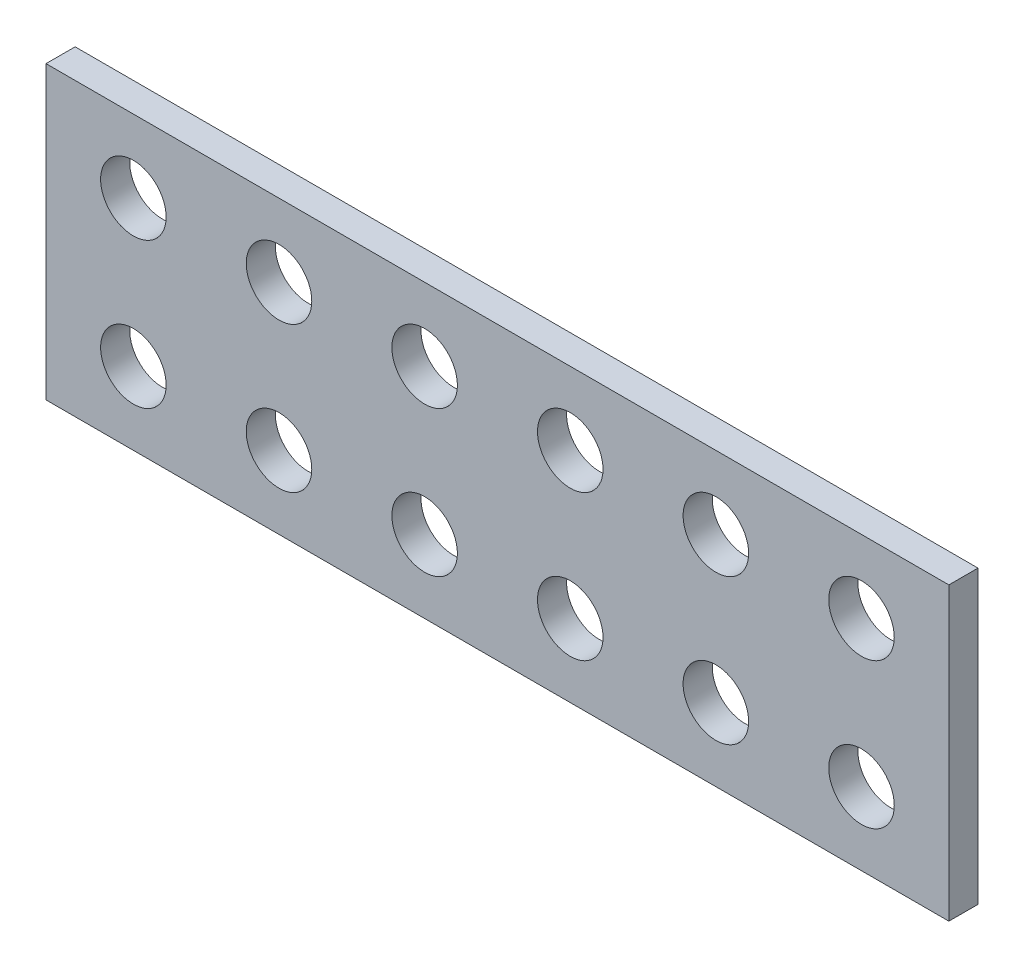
ISO-10303-21;
HEADER;
FILE_DESCRIPTION(('STEP AP214'),'2;1');
FILE_NAME('part.step','',(''),(''),'','','');
FILE_SCHEMA(('AUTOMOTIVE_DESIGN { 1 0 10303 214 1 1 1 1 }'));
ENDSEC;
DATA;
#1=APPLICATION_CONTEXT('core data for automotive mechanical design processes');
#2=APPLICATION_PROTOCOL_DEFINITION('international standard','automotive_design',2000,#1);
#3=PRODUCT_CONTEXT('',#1,'mechanical');
#4=PRODUCT('Part','Part','',(#3));
#5=PRODUCT_RELATED_PRODUCT_CATEGORY('part','',(#4));
#6=PRODUCT_DEFINITION_FORMATION('','',#4);
#7=PRODUCT_DEFINITION_CONTEXT('part definition',#1,'design');
#8=PRODUCT_DEFINITION('design','',#6,#7);
#9=PRODUCT_DEFINITION_SHAPE('','',#8);
#10=(LENGTH_UNIT() NAMED_UNIT(*) SI_UNIT(.MILLI.,.METRE.));
#11=(NAMED_UNIT(*) PLANE_ANGLE_UNIT() SI_UNIT($,.RADIAN.));
#12=(NAMED_UNIT(*) SI_UNIT($,.STERADIAN.) SOLID_ANGLE_UNIT());
#13=UNCERTAINTY_MEASURE_WITH_UNIT(LENGTH_MEASURE(1.E-05),#10,'distance_accuracy_value','');
#14=(GEOMETRIC_REPRESENTATION_CONTEXT(3) GLOBAL_UNCERTAINTY_ASSIGNED_CONTEXT((#13)) GLOBAL_UNIT_ASSIGNED_CONTEXT((#10,
#11,#12)) REPRESENTATION_CONTEXT('',''));
#15=CARTESIAN_POINT('',(0.,0.,0.));
#16=DIRECTION('',(0.,0.,1.));
#17=DIRECTION('',(1.,0.,0.));
#18=AXIS2_PLACEMENT_3D('',#15,#16,#17);
#19=CARTESIAN_POINT('',(0.,0.,4.));
#20=DIRECTION('',(0.,0.,-1.));
#21=DIRECTION('',(-1.,0.,0.));
#22=AXIS2_PLACEMENT_3D('',#19,#20,#21);
#23=PLANE('',#22);
#24=CARTESIAN_POINT('',(20.0000000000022,40.,4.));
#25=DIRECTION('',(0.,0.,1.));
#26=DIRECTION('',(1.,0.,0.));
#27=AXIS2_PLACEMENT_3D('',#24,#25,#26);
#28=CIRCLE('',#27,4.5);
#29=CARTESIAN_POINT('',(24.5000000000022,40.,4.));
#30=VERTEX_POINT('',#29);
#31=EDGE_CURVE('E40',#30,#30,#28,.T.);
#32=ORIENTED_EDGE('',*,*,#31,.F.);
#33=EDGE_LOOP('',(#32));
#34=FACE_BOUND('',#33,.T.);
#35=CARTESIAN_POINT('',(40.0000000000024,20.,4.));
#36=DIRECTION('',(0.,0.,1.));
#37=DIRECTION('',(1.,0.,0.));
#38=AXIS2_PLACEMENT_3D('',#35,#36,#37);
#39=CIRCLE('',#38,4.50000000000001);
#40=CARTESIAN_POINT('',(44.5000000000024,20.,4.));
#41=VERTEX_POINT('',#40);
#42=EDGE_CURVE('E162',#41,#41,#39,.T.);
#43=ORIENTED_EDGE('',*,*,#42,.F.);
#44=EDGE_LOOP('',(#43));
#45=FACE_BOUND('',#44,.T.);
#46=CARTESIAN_POINT('',(60.0000000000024,20.,4.));
#47=DIRECTION('',(0.,0.,1.));
#48=DIRECTION('',(1.,0.,0.));
#49=AXIS2_PLACEMENT_3D('',#46,#47,#48);
#50=CIRCLE('',#49,4.49999999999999);
#51=CARTESIAN_POINT('',(64.5000000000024,20.,4.));
#52=VERTEX_POINT('',#51);
#53=EDGE_CURVE('E168',#52,#52,#50,.T.);
#54=ORIENTED_EDGE('',*,*,#53,.F.);
#55=EDGE_LOOP('',(#54));
#56=FACE_BOUND('',#55,.T.);
#57=CARTESIAN_POINT('',(80.0000000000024,20.,4.));
#58=DIRECTION('',(0.,0.,1.));
#59=DIRECTION('',(1.,0.,0.));
#60=AXIS2_PLACEMENT_3D('',#57,#58,#59);
#61=CIRCLE('',#60,4.50000000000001);
#62=CARTESIAN_POINT('',(84.5000000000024,20.,4.));
#63=VERTEX_POINT('',#62);
#64=EDGE_CURVE('E157',#63,#63,#61,.T.);
#65=ORIENTED_EDGE('',*,*,#64,.F.);
#66=EDGE_LOOP('',(#65));
#67=FACE_BOUND('',#66,.T.);
#68=CARTESIAN_POINT('',(20.0000000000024,20.,4.));
#69=DIRECTION('',(0.,0.,1.));
#70=DIRECTION('',(1.,0.,0.));
#71=AXIS2_PLACEMENT_3D('',#68,#69,#70);
#72=CIRCLE('',#71,4.5);
#73=CARTESIAN_POINT('',(24.5000000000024,20.,4.));
#74=VERTEX_POINT('',#73);
#75=EDGE_CURVE('E108',#74,#74,#72,.T.);
#76=ORIENTED_EDGE('',*,*,#75,.F.);
#77=EDGE_LOOP('',(#76));
#78=FACE_BOUND('',#77,.T.);
#79=CARTESIAN_POINT('',(120.000000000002,20.,4.));
#80=DIRECTION('',(0.,0.,1.));
#81=DIRECTION('',(1.,0.,0.));
#82=AXIS2_PLACEMENT_3D('',#79,#80,#81);
#83=CIRCLE('',#82,4.50000000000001);
#84=CARTESIAN_POINT('',(124.500000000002,20.,4.));
#85=VERTEX_POINT('',#84);
#86=EDGE_CURVE('E146',#85,#85,#83,.T.);
#87=ORIENTED_EDGE('',*,*,#86,.F.);
#88=EDGE_LOOP('',(#87));
#89=FACE_BOUND('',#88,.T.);
#90=CARTESIAN_POINT('',(100.000000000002,20.,4.));
#91=DIRECTION('',(0.,0.,1.));
#92=DIRECTION('',(1.,0.,0.));
#93=AXIS2_PLACEMENT_3D('',#90,#91,#92);
#94=CIRCLE('',#93,4.50000000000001);
#95=CARTESIAN_POINT('',(104.500000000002,20.,4.));
#96=VERTEX_POINT('',#95);
#97=EDGE_CURVE('E145',#96,#96,#94,.T.);
#98=ORIENTED_EDGE('',*,*,#97,.F.);
#99=EDGE_LOOP('',(#98));
#100=FACE_BOUND('',#99,.T.);
#101=CARTESIAN_POINT('',(120.000000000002,40.,4.));
#102=DIRECTION('',(0.,0.,1.));
#103=DIRECTION('',(1.,0.,0.));
#104=AXIS2_PLACEMENT_3D('',#101,#102,#103);
#105=CIRCLE('',#104,4.50000000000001);
#106=CARTESIAN_POINT('',(124.500000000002,40.,4.));
#107=VERTEX_POINT('',#106);
#108=EDGE_CURVE('E138',#107,#107,#105,.T.);
#109=ORIENTED_EDGE('',*,*,#108,.F.);
#110=EDGE_LOOP('',(#109));
#111=FACE_BOUND('',#110,.T.);
#112=CARTESIAN_POINT('',(100.000000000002,40.,4.));
#113=DIRECTION('',(0.,0.,1.));
#114=DIRECTION('',(1.,0.,0.));
#115=AXIS2_PLACEMENT_3D('',#112,#113,#114);
#116=CIRCLE('',#115,4.50000000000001);
#117=CARTESIAN_POINT('',(104.500000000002,40.,4.));
#118=VERTEX_POINT('',#117);
#119=EDGE_CURVE('E132',#118,#118,#116,.T.);
#120=ORIENTED_EDGE('',*,*,#119,.F.);
#121=EDGE_LOOP('',(#120));
#122=FACE_BOUND('',#121,.T.);
#123=CARTESIAN_POINT('',(80.0000000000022,40.,4.));
#124=DIRECTION('',(0.,0.,1.));
#125=DIRECTION('',(1.,0.,0.));
#126=AXIS2_PLACEMENT_3D('',#123,#124,#125);
#127=CIRCLE('',#126,4.50000000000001);
#128=CARTESIAN_POINT('',(84.5000000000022,40.,4.));
#129=VERTEX_POINT('',#128);
#130=EDGE_CURVE('E126',#129,#129,#127,.T.);
#131=ORIENTED_EDGE('',*,*,#130,.F.);
#132=EDGE_LOOP('',(#131));
#133=FACE_BOUND('',#132,.T.);
#134=CARTESIAN_POINT('',(60.0000000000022,40.,4.));
#135=DIRECTION('',(0.,0.,1.));
#136=DIRECTION('',(1.,0.,0.));
#137=AXIS2_PLACEMENT_3D('',#134,#135,#136);
#138=CIRCLE('',#137,4.50000000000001);
#139=CARTESIAN_POINT('',(64.5000000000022,40.,4.));
#140=VERTEX_POINT('',#139);
#141=EDGE_CURVE('E120',#140,#140,#138,.T.);
#142=ORIENTED_EDGE('',*,*,#141,.F.);
#143=EDGE_LOOP('',(#142));
#144=FACE_BOUND('',#143,.T.);
#145=CARTESIAN_POINT('',(40.0000000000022,40.,4.));
#146=DIRECTION('',(0.,0.,1.));
#147=DIRECTION('',(1.,0.,0.));
#148=AXIS2_PLACEMENT_3D('',#145,#146,#147);
#149=CIRCLE('',#148,4.50000000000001);
#150=CARTESIAN_POINT('',(44.5000000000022,40.,4.));
#151=VERTEX_POINT('',#150);
#152=EDGE_CURVE('E114',#151,#151,#149,.T.);
#153=ORIENTED_EDGE('',*,*,#152,.F.);
#154=EDGE_LOOP('',(#153));
#155=FACE_BOUND('',#154,.T.);
#156=DIRECTION('',(0.,-1.,0.));
#157=VECTOR('',#156,1.);
#158=CARTESIAN_POINT('',(8.,10.,4.));
#159=LINE('',#158,#157);
#160=CARTESIAN_POINT('',(8.,50.,4.));
#161=VERTEX_POINT('',#160);
#162=CARTESIAN_POINT('',(8.00000000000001,10.,4.));
#163=VERTEX_POINT('',#162);
#164=EDGE_CURVE('E100',#161,#163,#159,.T.);
#165=ORIENTED_EDGE('',*,*,#164,.T.);
#166=DIRECTION('',(1.,0.,0.));
#167=VECTOR('',#166,1.);
#168=CARTESIAN_POINT('',(8.,10.,4.));
#169=LINE('',#168,#167);
#170=CARTESIAN_POINT('',(132.,10.,4.));
#171=VERTEX_POINT('',#170);
#172=EDGE_CURVE('E103',#163,#171,#169,.T.);
#173=ORIENTED_EDGE('',*,*,#172,.T.);
#174=DIRECTION('',(0.,1.,0.));
#175=VECTOR('',#174,1.);
#176=CARTESIAN_POINT('',(132.,10.,4.));
#177=LINE('',#176,#175);
#178=CARTESIAN_POINT('',(132.,50.,4.));
#179=VERTEX_POINT('',#178);
#180=EDGE_CURVE('E51',#171,#179,#177,.T.);
#181=ORIENTED_EDGE('',*,*,#180,.T.);
#182=DIRECTION('',(-1.,0.,0.));
#183=VECTOR('',#182,1.);
#184=CARTESIAN_POINT('',(8.,50.,4.));
#185=LINE('',#184,#183);
#186=EDGE_CURVE('E83',#179,#161,#185,.T.);
#187=ORIENTED_EDGE('',*,*,#186,.T.);
#188=EDGE_LOOP('',(#165,#173,#181,#187));
#189=FACE_BOUND('',#188,.T.);
#190=ADVANCED_FACE('F36',(#34,#45,#56,#67,#78,#89,#100,#111,#122,#133,#144,#155,#189),#23,.F.);
#191=CARTESIAN_POINT('',(0.,0.,0.));
#192=DIRECTION('',(0.,0.,-1.));
#193=DIRECTION('',(-1.,0.,0.));
#194=AXIS2_PLACEMENT_3D('',#191,#192,#193);
#195=PLANE('',#194);
#196=CARTESIAN_POINT('',(20.0000000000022,40.,0.));
#197=DIRECTION('',(0.,0.,1.));
#198=DIRECTION('',(1.,0.,0.));
#199=AXIS2_PLACEMENT_3D('',#196,#197,#198);
#200=CIRCLE('',#199,4.5);
#201=CARTESIAN_POINT('',(24.5000000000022,40.,0.));
#202=VERTEX_POINT('',#201);
#203=EDGE_CURVE('E12',#202,#202,#200,.T.);
#204=ORIENTED_EDGE('',*,*,#203,.T.);
#205=EDGE_LOOP('',(#204));
#206=FACE_BOUND('',#205,.T.);
#207=CARTESIAN_POINT('',(40.0000000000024,20.,0.));
#208=DIRECTION('',(0.,0.,1.));
#209=DIRECTION('',(1.,0.,0.));
#210=AXIS2_PLACEMENT_3D('',#207,#208,#209);
#211=CIRCLE('',#210,4.50000000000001);
#212=CARTESIAN_POINT('',(44.5000000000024,20.,0.));
#213=VERTEX_POINT('',#212);
#214=EDGE_CURVE('E141',#213,#213,#211,.T.);
#215=ORIENTED_EDGE('',*,*,#214,.T.);
#216=EDGE_LOOP('',(#215));
#217=FACE_BOUND('',#216,.T.);
#218=CARTESIAN_POINT('',(60.0000000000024,20.,0.));
#219=DIRECTION('',(0.,0.,1.));
#220=DIRECTION('',(1.,0.,0.));
#221=AXIS2_PLACEMENT_3D('',#218,#219,#220);
#222=CIRCLE('',#221,4.49999999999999);
#223=CARTESIAN_POINT('',(64.5000000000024,20.,0.));
#224=VERTEX_POINT('',#223);
#225=EDGE_CURVE('E165',#224,#224,#222,.T.);
#226=ORIENTED_EDGE('',*,*,#225,.T.);
#227=EDGE_LOOP('',(#226));
#228=FACE_BOUND('',#227,.T.);
#229=CARTESIAN_POINT('',(80.0000000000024,20.,0.));
#230=DIRECTION('',(0.,0.,1.));
#231=DIRECTION('',(1.,0.,0.));
#232=AXIS2_PLACEMENT_3D('',#229,#230,#231);
#233=CIRCLE('',#232,4.50000000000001);
#234=CARTESIAN_POINT('',(84.5000000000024,20.,0.));
#235=VERTEX_POINT('',#234);
#236=EDGE_CURVE('E171',#235,#235,#233,.T.);
#237=ORIENTED_EDGE('',*,*,#236,.T.);
#238=EDGE_LOOP('',(#237));
#239=FACE_BOUND('',#238,.T.);
#240=CARTESIAN_POINT('',(20.0000000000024,20.,0.));
#241=DIRECTION('',(0.,0.,1.));
#242=DIRECTION('',(1.,0.,0.));
#243=AXIS2_PLACEMENT_3D('',#240,#241,#242);
#244=CIRCLE('',#243,4.5);
#245=CARTESIAN_POINT('',(24.5000000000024,20.,0.));
#246=VERTEX_POINT('',#245);
#247=EDGE_CURVE('E149',#246,#246,#244,.T.);
#248=ORIENTED_EDGE('',*,*,#247,.T.);
#249=EDGE_LOOP('',(#248));
#250=FACE_BOUND('',#249,.T.);
#251=CARTESIAN_POINT('',(120.000000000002,20.,0.));
#252=DIRECTION('',(0.,0.,1.));
#253=DIRECTION('',(1.,0.,0.));
#254=AXIS2_PLACEMENT_3D('',#251,#252,#253);
#255=CIRCLE('',#254,4.50000000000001);
#256=CARTESIAN_POINT('',(124.500000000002,20.,0.));
#257=VERTEX_POINT('',#256);
#258=EDGE_CURVE('E142',#257,#257,#255,.T.);
#259=ORIENTED_EDGE('',*,*,#258,.T.);
#260=EDGE_LOOP('',(#259));
#261=FACE_BOUND('',#260,.T.);
#262=CARTESIAN_POINT('',(100.000000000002,20.,0.));
#263=DIRECTION('',(0.,0.,1.));
#264=DIRECTION('',(1.,0.,0.));
#265=AXIS2_PLACEMENT_3D('',#262,#263,#264);
#266=CIRCLE('',#265,4.50000000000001);
#267=CARTESIAN_POINT('',(104.500000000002,20.,0.));
#268=VERTEX_POINT('',#267);
#269=EDGE_CURVE('E154',#268,#268,#266,.T.);
#270=ORIENTED_EDGE('',*,*,#269,.T.);
#271=EDGE_LOOP('',(#270));
#272=FACE_BOUND('',#271,.T.);
#273=CARTESIAN_POINT('',(120.000000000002,40.,0.));
#274=DIRECTION('',(0.,0.,1.));
#275=DIRECTION('',(1.,0.,0.));
#276=AXIS2_PLACEMENT_3D('',#273,#274,#275);
#277=CIRCLE('',#276,4.50000000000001);
#278=CARTESIAN_POINT('',(124.500000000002,40.,0.));
#279=VERTEX_POINT('',#278);
#280=EDGE_CURVE('E135',#279,#279,#277,.T.);
#281=ORIENTED_EDGE('',*,*,#280,.T.);
#282=EDGE_LOOP('',(#281));
#283=FACE_BOUND('',#282,.T.);
#284=CARTESIAN_POINT('',(100.000000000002,40.,0.));
#285=DIRECTION('',(0.,0.,1.));
#286=DIRECTION('',(1.,0.,0.));
#287=AXIS2_PLACEMENT_3D('',#284,#285,#286);
#288=CIRCLE('',#287,4.50000000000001);
#289=CARTESIAN_POINT('',(104.500000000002,40.,0.));
#290=VERTEX_POINT('',#289);
#291=EDGE_CURVE('E129',#290,#290,#288,.T.);
#292=ORIENTED_EDGE('',*,*,#291,.T.);
#293=EDGE_LOOP('',(#292));
#294=FACE_BOUND('',#293,.T.);
#295=CARTESIAN_POINT('',(80.0000000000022,40.,0.));
#296=DIRECTION('',(0.,0.,1.));
#297=DIRECTION('',(1.,0.,0.));
#298=AXIS2_PLACEMENT_3D('',#295,#296,#297);
#299=CIRCLE('',#298,4.50000000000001);
#300=CARTESIAN_POINT('',(84.5000000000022,40.,0.));
#301=VERTEX_POINT('',#300);
#302=EDGE_CURVE('E123',#301,#301,#299,.T.);
#303=ORIENTED_EDGE('',*,*,#302,.T.);
#304=EDGE_LOOP('',(#303));
#305=FACE_BOUND('',#304,.T.);
#306=CARTESIAN_POINT('',(60.0000000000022,40.,0.));
#307=DIRECTION('',(0.,0.,1.));
#308=DIRECTION('',(1.,0.,0.));
#309=AXIS2_PLACEMENT_3D('',#306,#307,#308);
#310=CIRCLE('',#309,4.50000000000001);
#311=CARTESIAN_POINT('',(64.5000000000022,40.,0.));
#312=VERTEX_POINT('',#311);
#313=EDGE_CURVE('E117',#312,#312,#310,.T.);
#314=ORIENTED_EDGE('',*,*,#313,.T.);
#315=EDGE_LOOP('',(#314));
#316=FACE_BOUND('',#315,.T.);
#317=CARTESIAN_POINT('',(40.0000000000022,40.,0.));
#318=DIRECTION('',(0.,0.,1.));
#319=DIRECTION('',(1.,0.,0.));
#320=AXIS2_PLACEMENT_3D('',#317,#318,#319);
#321=CIRCLE('',#320,4.50000000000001);
#322=CARTESIAN_POINT('',(44.5000000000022,40.,0.));
#323=VERTEX_POINT('',#322);
#324=EDGE_CURVE('E111',#323,#323,#321,.T.);
#325=ORIENTED_EDGE('',*,*,#324,.T.);
#326=EDGE_LOOP('',(#325));
#327=FACE_BOUND('',#326,.T.);
#328=DIRECTION('',(1.,0.,0.));
#329=VECTOR('',#328,1.);
#330=CARTESIAN_POINT('',(8.,10.,0.));
#331=LINE('',#330,#329);
#332=CARTESIAN_POINT('',(8.,10.,0.));
#333=VERTEX_POINT('',#332);
#334=CARTESIAN_POINT('',(132.,10.,0.));
#335=VERTEX_POINT('',#334);
#336=EDGE_CURVE('E93',#333,#335,#331,.T.);
#337=ORIENTED_EDGE('',*,*,#336,.F.);
#338=DIRECTION('',(0.,-1.,0.));
#339=VECTOR('',#338,1.);
#340=CARTESIAN_POINT('',(8.,10.,0.));
#341=LINE('',#340,#339);
#342=CARTESIAN_POINT('',(8.,50.,0.));
#343=VERTEX_POINT('',#342);
#344=EDGE_CURVE('E59',#343,#333,#341,.T.);
#345=ORIENTED_EDGE('',*,*,#344,.F.);
#346=DIRECTION('',(-1.,0.,0.));
#347=VECTOR('',#346,1.);
#348=CARTESIAN_POINT('',(8.,50.,0.));
#349=LINE('',#348,#347);
#350=CARTESIAN_POINT('',(132.,50.,0.));
#351=VERTEX_POINT('',#350);
#352=EDGE_CURVE('E81',#351,#343,#349,.T.);
#353=ORIENTED_EDGE('',*,*,#352,.F.);
#354=DIRECTION('',(0.,1.,0.));
#355=VECTOR('',#354,1.);
#356=CARTESIAN_POINT('',(132.,10.,0.));
#357=LINE('',#356,#355);
#358=EDGE_CURVE('E88',#335,#351,#357,.T.);
#359=ORIENTED_EDGE('',*,*,#358,.F.);
#360=EDGE_LOOP('',(#337,#345,#353,#359));
#361=FACE_BOUND('',#360,.T.);
#362=ADVANCED_FACE('F38',(#206,#217,#228,#239,#250,#261,#272,#283,#294,#305,#316,#327,#361),
#195,.T.);
#363=CARTESIAN_POINT('',(20.0000000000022,40.,0.));
#364=DIRECTION('',(0.,0.,1.));
#365=DIRECTION('',(1.,0.,0.));
#366=AXIS2_PLACEMENT_3D('',#363,#364,#365);
#367=CYLINDRICAL_SURFACE('',#366,4.5);
#368=ORIENTED_EDGE('',*,*,#203,.F.);
#369=EDGE_LOOP('',(#368));
#370=FACE_BOUND('',#369,.T.);
#371=ORIENTED_EDGE('',*,*,#31,.T.);
#372=EDGE_LOOP('',(#371));
#373=FACE_BOUND('',#372,.T.);
#374=ADVANCED_FACE('F250',(#370,#373),#367,.F.);
#375=CARTESIAN_POINT('',(40.0000000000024,20.,0.));
#376=DIRECTION('',(0.,0.,1.));
#377=DIRECTION('',(1.,0.,0.));
#378=AXIS2_PLACEMENT_3D('',#375,#376,#377);
#379=CYLINDRICAL_SURFACE('',#378,4.50000000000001);
#380=ORIENTED_EDGE('',*,*,#214,.F.);
#381=EDGE_LOOP('',(#380));
#382=FACE_BOUND('',#381,.T.);
#383=ORIENTED_EDGE('',*,*,#42,.T.);
#384=EDGE_LOOP('',(#383));
#385=FACE_BOUND('',#384,.T.);
#386=ADVANCED_FACE('F246',(#382,#385),#379,.F.);
#387=CARTESIAN_POINT('',(60.0000000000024,20.,0.));
#388=DIRECTION('',(0.,0.,1.));
#389=DIRECTION('',(1.,0.,0.));
#390=AXIS2_PLACEMENT_3D('',#387,#388,#389);
#391=CYLINDRICAL_SURFACE('',#390,4.49999999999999);
#392=ORIENTED_EDGE('',*,*,#225,.F.);
#393=EDGE_LOOP('',(#392));
#394=FACE_BOUND('',#393,.T.);
#395=ORIENTED_EDGE('',*,*,#53,.T.);
#396=EDGE_LOOP('',(#395));
#397=FACE_BOUND('',#396,.T.);
#398=ADVANCED_FACE('F249',(#394,#397),#391,.F.);
#399=CARTESIAN_POINT('',(80.0000000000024,20.,0.));
#400=DIRECTION('',(0.,0.,1.));
#401=DIRECTION('',(1.,0.,0.));
#402=AXIS2_PLACEMENT_3D('',#399,#400,#401);
#403=CYLINDRICAL_SURFACE('',#402,4.50000000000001);
#404=ORIENTED_EDGE('',*,*,#236,.F.);
#405=EDGE_LOOP('',(#404));
#406=FACE_BOUND('',#405,.T.);
#407=ORIENTED_EDGE('',*,*,#64,.T.);
#408=EDGE_LOOP('',(#407));
#409=FACE_BOUND('',#408,.T.);
#410=ADVANCED_FACE('F177',(#406,#409),#403,.F.);
#411=CARTESIAN_POINT('',(20.0000000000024,20.,0.));
#412=DIRECTION('',(0.,0.,1.));
#413=DIRECTION('',(1.,0.,0.));
#414=AXIS2_PLACEMENT_3D('',#411,#412,#413);
#415=CYLINDRICAL_SURFACE('',#414,4.5);
#416=ORIENTED_EDGE('',*,*,#247,.F.);
#417=EDGE_LOOP('',(#416));
#418=FACE_BOUND('',#417,.T.);
#419=ORIENTED_EDGE('',*,*,#75,.T.);
#420=EDGE_LOOP('',(#419));
#421=FACE_BOUND('',#420,.T.);
#422=ADVANCED_FACE('F238',(#418,#421),#415,.F.);
#423=CARTESIAN_POINT('',(120.000000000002,20.,0.));
#424=DIRECTION('',(0.,0.,1.));
#425=DIRECTION('',(1.,0.,0.));
#426=AXIS2_PLACEMENT_3D('',#423,#424,#425);
#427=CYLINDRICAL_SURFACE('',#426,4.50000000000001);
#428=ORIENTED_EDGE('',*,*,#258,.F.);
#429=EDGE_LOOP('',(#428));
#430=FACE_BOUND('',#429,.T.);
#431=ORIENTED_EDGE('',*,*,#86,.T.);
#432=EDGE_LOOP('',(#431));
#433=FACE_BOUND('',#432,.T.);
#434=ADVANCED_FACE('F235',(#430,#433),#427,.F.);
#435=CARTESIAN_POINT('',(100.000000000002,20.,0.));
#436=DIRECTION('',(0.,0.,1.));
#437=DIRECTION('',(1.,0.,0.));
#438=AXIS2_PLACEMENT_3D('',#435,#436,#437);
#439=CYLINDRICAL_SURFACE('',#438,4.50000000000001);
#440=ORIENTED_EDGE('',*,*,#269,.F.);
#441=EDGE_LOOP('',(#440));
#442=FACE_BOUND('',#441,.T.);
#443=ORIENTED_EDGE('',*,*,#97,.T.);
#444=EDGE_LOOP('',(#443));
#445=FACE_BOUND('',#444,.T.);
#446=ADVANCED_FACE('F233',(#442,#445),#439,.F.);
#447=CARTESIAN_POINT('',(120.000000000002,40.,0.));
#448=DIRECTION('',(0.,0.,1.));
#449=DIRECTION('',(1.,0.,0.));
#450=AXIS2_PLACEMENT_3D('',#447,#448,#449);
#451=CYLINDRICAL_SURFACE('',#450,4.50000000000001);
#452=ORIENTED_EDGE('',*,*,#280,.F.);
#453=EDGE_LOOP('',(#452));
#454=FACE_BOUND('',#453,.T.);
#455=ORIENTED_EDGE('',*,*,#108,.T.);
#456=EDGE_LOOP('',(#455));
#457=FACE_BOUND('',#456,.T.);
#458=ADVANCED_FACE('F229',(#454,#457),#451,.F.);
#459=CARTESIAN_POINT('',(100.000000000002,40.,0.));
#460=DIRECTION('',(0.,0.,1.));
#461=DIRECTION('',(1.,0.,0.));
#462=AXIS2_PLACEMENT_3D('',#459,#460,#461);
#463=CYLINDRICAL_SURFACE('',#462,4.50000000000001);
#464=ORIENTED_EDGE('',*,*,#291,.F.);
#465=EDGE_LOOP('',(#464));
#466=FACE_BOUND('',#465,.T.);
#467=ORIENTED_EDGE('',*,*,#119,.T.);
#468=EDGE_LOOP('',(#467));
#469=FACE_BOUND('',#468,.T.);
#470=ADVANCED_FACE('F225',(#466,#469),#463,.F.);
#471=CARTESIAN_POINT('',(80.0000000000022,40.,0.));
#472=DIRECTION('',(0.,0.,1.));
#473=DIRECTION('',(1.,0.,0.));
#474=AXIS2_PLACEMENT_3D('',#471,#472,#473);
#475=CYLINDRICAL_SURFACE('',#474,4.50000000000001);
#476=ORIENTED_EDGE('',*,*,#302,.F.);
#477=EDGE_LOOP('',(#476));
#478=FACE_BOUND('',#477,.T.);
#479=ORIENTED_EDGE('',*,*,#130,.T.);
#480=EDGE_LOOP('',(#479));
#481=FACE_BOUND('',#480,.T.);
#482=ADVANCED_FACE('F221',(#478,#481),#475,.F.);
#483=CARTESIAN_POINT('',(60.0000000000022,40.,0.));
#484=DIRECTION('',(0.,0.,1.));
#485=DIRECTION('',(1.,0.,0.));
#486=AXIS2_PLACEMENT_3D('',#483,#484,#485);
#487=CYLINDRICAL_SURFACE('',#486,4.50000000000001);
#488=ORIENTED_EDGE('',*,*,#313,.F.);
#489=EDGE_LOOP('',(#488));
#490=FACE_BOUND('',#489,.T.);
#491=ORIENTED_EDGE('',*,*,#141,.T.);
#492=EDGE_LOOP('',(#491));
#493=FACE_BOUND('',#492,.T.);
#494=ADVANCED_FACE('F217',(#490,#493),#487,.F.);
#495=CARTESIAN_POINT('',(40.0000000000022,40.,0.));
#496=DIRECTION('',(0.,0.,1.));
#497=DIRECTION('',(1.,0.,0.));
#498=AXIS2_PLACEMENT_3D('',#495,#496,#497);
#499=CYLINDRICAL_SURFACE('',#498,4.50000000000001);
#500=ORIENTED_EDGE('',*,*,#324,.F.);
#501=EDGE_LOOP('',(#500));
#502=FACE_BOUND('',#501,.T.);
#503=ORIENTED_EDGE('',*,*,#152,.T.);
#504=EDGE_LOOP('',(#503));
#505=FACE_BOUND('',#504,.T.);
#506=ADVANCED_FACE('F214',(#502,#505),#499,.F.);
#507=CARTESIAN_POINT('',(8.,10.,0.));
#508=DIRECTION('',(-1.,0.,0.));
#509=DIRECTION('',(0.,0.,1.));
#510=AXIS2_PLACEMENT_3D('',#507,#508,#509);
#511=PLANE('',#510);
#512=ORIENTED_EDGE('',*,*,#164,.F.);
#513=DIRECTION('',(0.,0.,1.));
#514=VECTOR('',#513,1.);
#515=CARTESIAN_POINT('',(8.,50.,0.));
#516=LINE('',#515,#514);
#517=EDGE_CURVE('E84',#343,#161,#516,.T.);
#518=ORIENTED_EDGE('',*,*,#517,.F.);
#519=ORIENTED_EDGE('',*,*,#344,.T.);
#520=DIRECTION('',(0.,0.,1.));
#521=VECTOR('',#520,1.);
#522=CARTESIAN_POINT('',(8.,10.,0.));
#523=LINE('',#522,#521);
#524=EDGE_CURVE('E95',#333,#163,#523,.T.);
#525=ORIENTED_EDGE('',*,*,#524,.T.);
#526=EDGE_LOOP('',(#512,#518,#519,#525));
#527=FACE_BOUND('',#526,.T.);
#528=ADVANCED_FACE('F200',(#527),#511,.T.);
#529=CARTESIAN_POINT('',(8.,50.,0.));
#530=DIRECTION('',(0.,1.,0.));
#531=DIRECTION('',(0.,0.,1.));
#532=AXIS2_PLACEMENT_3D('',#529,#530,#531);
#533=PLANE('',#532);
#534=ORIENTED_EDGE('',*,*,#186,.F.);
#535=DIRECTION('',(0.,0.,1.));
#536=VECTOR('',#535,1.);
#537=CARTESIAN_POINT('',(132.,50.,0.));
#538=LINE('',#537,#536);
#539=EDGE_CURVE('E77',#351,#179,#538,.T.);
#540=ORIENTED_EDGE('',*,*,#539,.F.);
#541=ORIENTED_EDGE('',*,*,#352,.T.);
#542=ORIENTED_EDGE('',*,*,#517,.T.);
#543=EDGE_LOOP('',(#534,#540,#541,#542));
#544=FACE_BOUND('',#543,.T.);
#545=ADVANCED_FACE('F79',(#544),#533,.T.);
#546=CARTESIAN_POINT('',(132.,10.,0.));
#547=DIRECTION('',(1.,0.,0.));
#548=DIRECTION('',(0.,0.,-1.));
#549=AXIS2_PLACEMENT_3D('',#546,#547,#548);
#550=PLANE('',#549);
#551=ORIENTED_EDGE('',*,*,#180,.F.);
#552=DIRECTION('',(0.,0.,1.));
#553=VECTOR('',#552,1.);
#554=CARTESIAN_POINT('',(132.,10.,0.));
#555=LINE('',#554,#553);
#556=EDGE_CURVE('E85',#335,#171,#555,.T.);
#557=ORIENTED_EDGE('',*,*,#556,.F.);
#558=ORIENTED_EDGE('',*,*,#358,.T.);
#559=ORIENTED_EDGE('',*,*,#539,.T.);
#560=EDGE_LOOP('',(#551,#557,#558,#559));
#561=FACE_BOUND('',#560,.T.);
#562=ADVANCED_FACE('F89',(#561),#550,.T.);
#563=CARTESIAN_POINT('',(8.,10.,0.));
#564=DIRECTION('',(0.,-1.,0.));
#565=DIRECTION('',(0.,0.,-1.));
#566=AXIS2_PLACEMENT_3D('',#563,#564,#565);
#567=PLANE('',#566);
#568=ORIENTED_EDGE('',*,*,#172,.F.);
#569=ORIENTED_EDGE('',*,*,#524,.F.);
#570=ORIENTED_EDGE('',*,*,#336,.T.);
#571=ORIENTED_EDGE('',*,*,#556,.T.);
#572=EDGE_LOOP('',(#568,#569,#570,#571));
#573=FACE_BOUND('',#572,.T.);
#574=ADVANCED_FACE('F202',(#573),#567,.T.);
#575=CLOSED_SHELL('',(#190,#362,#374,#386,#398,#410,#422,#434,#446,#458,#470,#482,#494,#506,
#528,#545,#562,#574));
#576=MANIFOLD_SOLID_BREP('B2',#575);
#577=ADVANCED_BREP_SHAPE_REPRESENTATION('',(#18,#576),#14);
#578=SHAPE_DEFINITION_REPRESENTATION(#9,#577);
ENDSEC;
END-ISO-10303-21;
